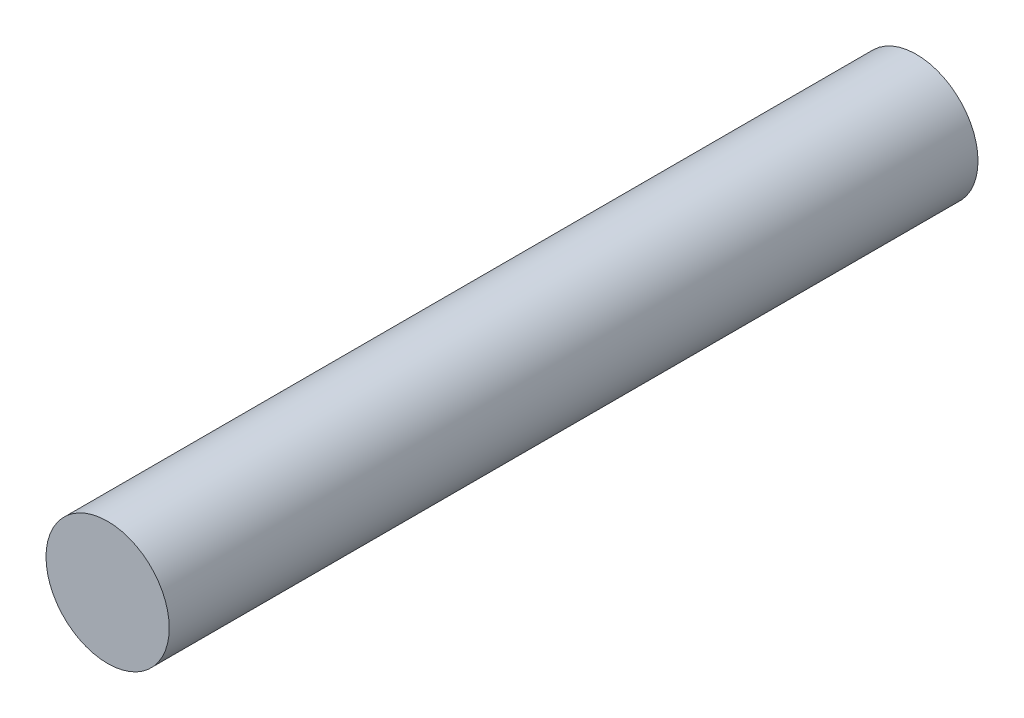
ISO-10303-21;
HEADER;
FILE_DESCRIPTION(('STEP AP214'),'2;1');
FILE_NAME('part.step','',(''),(''),'','','');
FILE_SCHEMA(('AUTOMOTIVE_DESIGN { 1 0 10303 214 1 1 1 1 }'));
ENDSEC;
DATA;
#1=APPLICATION_CONTEXT('core data for automotive mechanical design processes');
#2=APPLICATION_PROTOCOL_DEFINITION('international standard','automotive_design',2000,#1);
#3=PRODUCT_CONTEXT('',#1,'mechanical');
#4=PRODUCT('Part','Part','',(#3));
#5=PRODUCT_RELATED_PRODUCT_CATEGORY('part','',(#4));
#6=PRODUCT_DEFINITION_FORMATION('','',#4);
#7=PRODUCT_DEFINITION_CONTEXT('part definition',#1,'design');
#8=PRODUCT_DEFINITION('design','',#6,#7);
#9=PRODUCT_DEFINITION_SHAPE('','',#8);
#10=(LENGTH_UNIT() NAMED_UNIT(*) SI_UNIT(.MILLI.,.METRE.));
#11=(NAMED_UNIT(*) PLANE_ANGLE_UNIT() SI_UNIT($,.RADIAN.));
#12=(NAMED_UNIT(*) SI_UNIT($,.STERADIAN.) SOLID_ANGLE_UNIT());
#13=UNCERTAINTY_MEASURE_WITH_UNIT(LENGTH_MEASURE(1.E-05),#10,'distance_accuracy_value','');
#14=(GEOMETRIC_REPRESENTATION_CONTEXT(3) GLOBAL_UNCERTAINTY_ASSIGNED_CONTEXT((#13)) GLOBAL_UNIT_ASSIGNED_CONTEXT((#10,
#11,#12)) REPRESENTATION_CONTEXT('',''));
#15=CARTESIAN_POINT('',(0.,0.,0.));
#16=DIRECTION('',(0.,0.,1.));
#17=DIRECTION('',(1.,0.,0.));
#18=AXIS2_PLACEMENT_3D('',#15,#16,#17);
#19=CARTESIAN_POINT('',(0.,0.,10.5));
#20=DIRECTION('',(0.,0.,1.));
#21=DIRECTION('',(1.,0.,0.));
#22=AXIS2_PLACEMENT_3D('',#19,#20,#21);
#23=PLANE('',#22);
#24=CARTESIAN_POINT('',(0.,0.,10.5));
#25=DIRECTION('',(0.,0.,-1.));
#26=DIRECTION('',(-1.,0.,0.));
#27=AXIS2_PLACEMENT_3D('',#24,#25,#26);
#28=CIRCLE('',#27,1.6);
#29=CARTESIAN_POINT('',(-1.6,0.,10.5));
#30=VERTEX_POINT('',#29);
#31=EDGE_CURVE('E10',#30,#30,#28,.T.);
#32=ORIENTED_EDGE('',*,*,#31,.F.);
#33=EDGE_LOOP('',(#32));
#34=FACE_BOUND('',#33,.T.);
#35=ADVANCED_FACE('F15',(#34),#23,.T.);
#36=CARTESIAN_POINT('',(0.,0.,-10.5));
#37=DIRECTION('',(0.,0.,-1.));
#38=DIRECTION('',(-1.,0.,0.));
#39=AXIS2_PLACEMENT_3D('',#36,#37,#38);
#40=PLANE('',#39);
#41=CARTESIAN_POINT('',(0.,0.,-10.5));
#42=DIRECTION('',(0.,0.,1.));
#43=DIRECTION('',(1.,0.,0.));
#44=AXIS2_PLACEMENT_3D('',#41,#42,#43);
#45=CIRCLE('',#44,1.6);
#46=CARTESIAN_POINT('',(1.6,0.,-10.5));
#47=VERTEX_POINT('',#46);
#48=EDGE_CURVE('E22',#47,#47,#45,.T.);
#49=ORIENTED_EDGE('',*,*,#48,.F.);
#50=EDGE_LOOP('',(#49));
#51=FACE_BOUND('',#50,.T.);
#52=ADVANCED_FACE('F26',(#51),#40,.T.);
#53=CARTESIAN_POINT('',(0.,0.,-10.5));
#54=DIRECTION('',(0.,0.,1.));
#55=DIRECTION('',(1.,0.,0.));
#56=AXIS2_PLACEMENT_3D('',#53,#54,#55);
#57=CYLINDRICAL_SURFACE('',#56,1.6);
#58=ORIENTED_EDGE('',*,*,#31,.T.);
#59=EDGE_LOOP('',(#58));
#60=FACE_BOUND('',#59,.T.);
#61=ORIENTED_EDGE('',*,*,#48,.T.);
#62=EDGE_LOOP('',(#61));
#63=FACE_BOUND('',#62,.T.);
#64=ADVANCED_FACE('F17',(#60,#63),#57,.T.);
#65=CLOSED_SHELL('',(#35,#52,#64));
#66=MANIFOLD_SOLID_BREP('B1',#65);
#67=ADVANCED_BREP_SHAPE_REPRESENTATION('',(#18,#66),#14);
#68=SHAPE_DEFINITION_REPRESENTATION(#9,#67);
ENDSEC;
END-ISO-10303-21;
